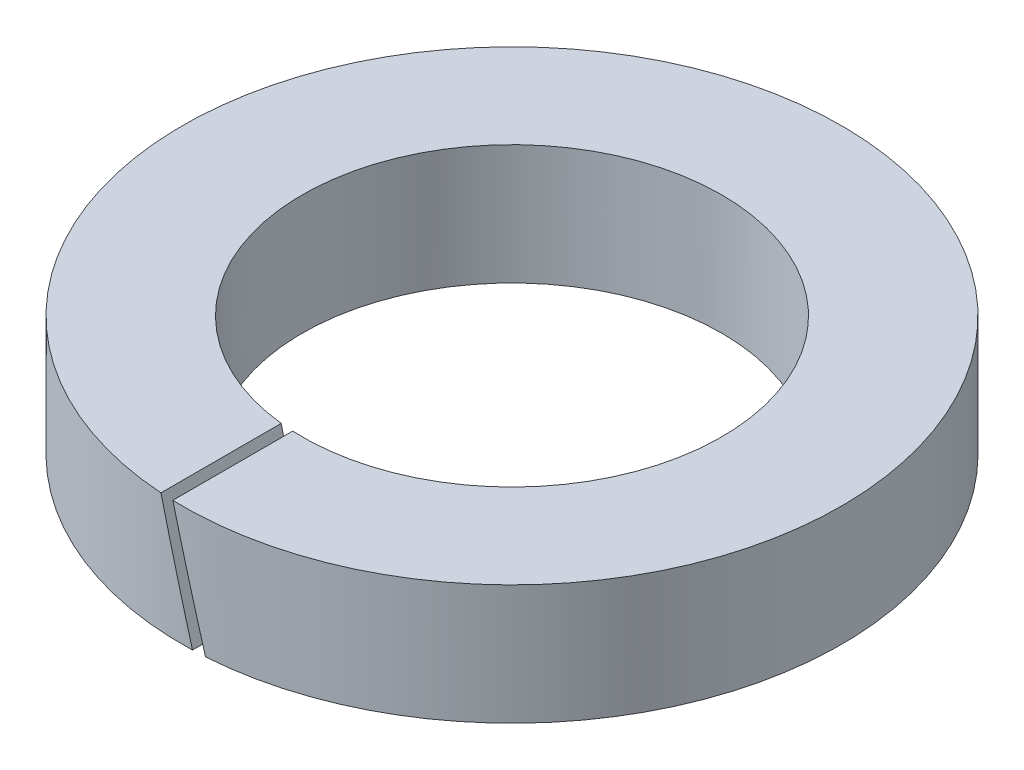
ISO-10303-21;
HEADER;
FILE_DESCRIPTION(('STEP AP214'),'2;1');
FILE_NAME('part.step','',(''),(''),'','','');
FILE_SCHEMA(('AUTOMOTIVE_DESIGN { 1 0 10303 214 1 1 1 1 }'));
ENDSEC;
DATA;
#1=APPLICATION_CONTEXT('core data for automotive mechanical design processes');
#2=APPLICATION_PROTOCOL_DEFINITION('international standard','automotive_design',2000,#1);
#3=PRODUCT_CONTEXT('',#1,'mechanical');
#4=PRODUCT('Part','Part','',(#3));
#5=PRODUCT_RELATED_PRODUCT_CATEGORY('part','',(#4));
#6=PRODUCT_DEFINITION_FORMATION('','',#4);
#7=PRODUCT_DEFINITION_CONTEXT('part definition',#1,'design');
#8=PRODUCT_DEFINITION('design','',#6,#7);
#9=PRODUCT_DEFINITION_SHAPE('','',#8);
#10=(LENGTH_UNIT() NAMED_UNIT(*) SI_UNIT(.MILLI.,.METRE.));
#11=(NAMED_UNIT(*) PLANE_ANGLE_UNIT() SI_UNIT($,.RADIAN.));
#12=(NAMED_UNIT(*) SI_UNIT($,.STERADIAN.) SOLID_ANGLE_UNIT());
#13=UNCERTAINTY_MEASURE_WITH_UNIT(LENGTH_MEASURE(1.E-05),#10,'distance_accuracy_value','');
#14=(GEOMETRIC_REPRESENTATION_CONTEXT(3) GLOBAL_UNCERTAINTY_ASSIGNED_CONTEXT((#13)) GLOBAL_UNIT_ASSIGNED_CONTEXT((#10,
#11,#12)) REPRESENTATION_CONTEXT('',''));
#15=CARTESIAN_POINT('',(0.,0.,0.));
#16=DIRECTION('',(0.,0.,1.));
#17=DIRECTION('',(1.,0.,0.));
#18=AXIS2_PLACEMENT_3D('',#15,#16,#17);
#19=CARTESIAN_POINT('',(0.,0.5,0.));
#20=DIRECTION('',(0.,1.,0.));
#21=DIRECTION('',(0.,0.,1.));
#22=AXIS2_PLACEMENT_3D('',#19,#20,#21);
#23=CYLINDRICAL_SURFACE('',#22,5.25);
#24=CARTESIAN_POINT('',(0.,2.07955549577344,0.));
#25=DIRECTION('',(-0.965925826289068,-0.258819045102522,0.));
#26=DIRECTION('',(-0.258819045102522,0.965925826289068,0.));
#27=AXIS2_PLACEMENT_3D('',#24,#25,#26);
#28=ELLIPSE('',#27,20.2844423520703,5.25);
#29=CARTESIAN_POINT('',(0.557215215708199,0.,5.2203458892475));
#30=VERTEX_POINT('',#29);
#31=CARTESIAN_POINT('',(-0.246632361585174,3.,5.24420370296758));
#32=VERTEX_POINT('',#31);
#33=EDGE_CURVE('E48',#30,#32,#28,.T.);
#34=ORIENTED_EDGE('',*,*,#33,.T.);
#35=CARTESIAN_POINT('',(0.,3.,0.));
#36=DIRECTION('',(0.,1.,0.));
#37=DIRECTION('',(0.,0.,1.));
#38=AXIS2_PLACEMENT_3D('',#35,#36,#37);
#39=CIRCLE('',#38,5.25);
#40=CARTESIAN_POINT('',(-0.557215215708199,3.,5.2203458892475));
#41=VERTEX_POINT('',#40);
#42=EDGE_CURVE('E11',#32,#41,#39,.T.);
#43=ORIENTED_EDGE('',*,*,#42,.T.);
#44=CARTESIAN_POINT('',(0.,0.920444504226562,0.));
#45=DIRECTION('',(-0.965925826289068,-0.258819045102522,0.));
#46=DIRECTION('',(-0.258819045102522,0.965925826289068,0.));
#47=AXIS2_PLACEMENT_3D('',#44,#45,#46);
#48=ELLIPSE('',#47,20.2844423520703,5.25);
#49=CARTESIAN_POINT('',(0.246632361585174,0.,5.24420370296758));
#50=VERTEX_POINT('',#49);
#51=EDGE_CURVE('E97',#50,#41,#48,.T.);
#52=ORIENTED_EDGE('',*,*,#51,.F.);
#53=CARTESIAN_POINT('',(0.,0.,0.));
#54=DIRECTION('',(0.,1.,0.));
#55=DIRECTION('',(0.,0.,1.));
#56=AXIS2_PLACEMENT_3D('',#53,#54,#55);
#57=CIRCLE('',#56,5.25);
#58=EDGE_CURVE('E90',#30,#50,#57,.T.);
#59=ORIENTED_EDGE('',*,*,#58,.F.);
#60=EDGE_LOOP('',(#34,#43,#52,#59));
#61=FACE_BOUND('',#60,.T.);
#62=ADVANCED_FACE('F34',(#61),#23,.F.);
#63=CARTESIAN_POINT('',(5.25,3.,0.));
#64=DIRECTION('',(0.,-1.,0.));
#65=DIRECTION('',(0.,0.,-1.));
#66=AXIS2_PLACEMENT_3D('',#63,#64,#65);
#67=PLANE('',#66);
#68=DIRECTION('',(0.,0.,1.));
#69=VECTOR('',#68,1.);
#70=CARTESIAN_POINT('',(-0.246632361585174,3.,-8.251));
#71=LINE('',#70,#69);
#72=CARTESIAN_POINT('',(-0.246632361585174,3.,8.24631265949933));
#73=VERTEX_POINT('',#72);
#74=EDGE_CURVE('E75',#32,#73,#71,.T.);
#75=ORIENTED_EDGE('',*,*,#74,.T.);
#76=CARTESIAN_POINT('',(0.,3.,0.));
#77=DIRECTION('',(0.,1.,0.));
#78=DIRECTION('',(0.,0.,1.));
#79=AXIS2_PLACEMENT_3D('',#76,#77,#78);
#80=CIRCLE('',#79,8.25);
#81=CARTESIAN_POINT('',(-0.557215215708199,3.,8.2311609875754));
#82=VERTEX_POINT('',#81);
#83=EDGE_CURVE('E41',#73,#82,#80,.T.);
#84=ORIENTED_EDGE('',*,*,#83,.T.);
#85=DIRECTION('',(0.,0.,1.));
#86=VECTOR('',#85,1.);
#87=CARTESIAN_POINT('',(-0.557215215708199,3.,-8.251));
#88=LINE('',#87,#86);
#89=EDGE_CURVE('E99',#41,#82,#88,.T.);
#90=ORIENTED_EDGE('',*,*,#89,.F.);
#91=ORIENTED_EDGE('',*,*,#42,.F.);
#92=EDGE_LOOP('',(#75,#84,#90,#91));
#93=FACE_BOUND('',#92,.T.);
#94=ADVANCED_FACE('F85',(#93),#67,.F.);
#95=CARTESIAN_POINT('',(0.,0.5,0.));
#96=DIRECTION('',(0.,1.,0.));
#97=DIRECTION('',(0.,0.,1.));
#98=AXIS2_PLACEMENT_3D('',#95,#96,#97);
#99=CYLINDRICAL_SURFACE('',#98,8.25);
#100=CARTESIAN_POINT('',(0.,2.07955549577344,0.));
#101=DIRECTION('',(-0.965925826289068,-0.258819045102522,0.));
#102=DIRECTION('',(-0.258819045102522,0.965925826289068,0.));
#103=AXIS2_PLACEMENT_3D('',#100,#101,#102);
#104=ELLIPSE('',#103,31.8755522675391,8.25);
#105=CARTESIAN_POINT('',(0.557215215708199,0.,8.2311609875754));
#106=VERTEX_POINT('',#105);
#107=EDGE_CURVE('E72',#73,#106,#104,.F.);
#108=ORIENTED_EDGE('',*,*,#107,.T.);
#109=CARTESIAN_POINT('',(0.,0.,0.));
#110=DIRECTION('',(0.,1.,0.));
#111=DIRECTION('',(0.,0.,1.));
#112=AXIS2_PLACEMENT_3D('',#109,#110,#111);
#113=CIRCLE('',#112,8.25);
#114=CARTESIAN_POINT('',(0.246632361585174,0.,8.24631265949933));
#115=VERTEX_POINT('',#114);
#116=EDGE_CURVE('E89',#106,#115,#113,.T.);
#117=ORIENTED_EDGE('',*,*,#116,.T.);
#118=CARTESIAN_POINT('',(0.,0.920444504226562,0.));
#119=DIRECTION('',(-0.965925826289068,-0.258819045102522,0.));
#120=DIRECTION('',(-0.258819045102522,0.965925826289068,0.));
#121=AXIS2_PLACEMENT_3D('',#118,#119,#120);
#122=ELLIPSE('',#121,31.8755522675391,8.25);
#123=EDGE_CURVE('E56',#82,#115,#122,.F.);
#124=ORIENTED_EDGE('',*,*,#123,.F.);
#125=ORIENTED_EDGE('',*,*,#83,.F.);
#126=EDGE_LOOP('',(#108,#117,#124,#125));
#127=FACE_BOUND('',#126,.T.);
#128=ADVANCED_FACE('F88',(#127),#99,.T.);
#129=CARTESIAN_POINT('',(5.25,0.,0.));
#130=DIRECTION('',(0.,1.,0.));
#131=DIRECTION('',(0.,0.,1.));
#132=AXIS2_PLACEMENT_3D('',#129,#130,#131);
#133=PLANE('',#132);
#134=DIRECTION('',(0.,0.,-1.));
#135=VECTOR('',#134,1.);
#136=CARTESIAN_POINT('',(0.557215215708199,0.,-8.251));
#137=LINE('',#136,#135);
#138=EDGE_CURVE('E76',#106,#30,#137,.T.);
#139=ORIENTED_EDGE('',*,*,#138,.T.);
#140=ORIENTED_EDGE('',*,*,#58,.T.);
#141=DIRECTION('',(0.,0.,-1.));
#142=VECTOR('',#141,1.);
#143=CARTESIAN_POINT('',(0.246632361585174,0.,-8.251));
#144=LINE('',#143,#142);
#145=EDGE_CURVE('E101',#115,#50,#144,.T.);
#146=ORIENTED_EDGE('',*,*,#145,.F.);
#147=ORIENTED_EDGE('',*,*,#116,.F.);
#148=EDGE_LOOP('',(#139,#140,#146,#147));
#149=FACE_BOUND('',#148,.T.);
#150=ADVANCED_FACE('F108',(#149),#133,.F.);
#151=CARTESIAN_POINT('',(-0.14488887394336,1.46117714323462,-8.251));
#152=DIRECTION('',(-0.965925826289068,-0.258819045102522,0.));
#153=DIRECTION('',(0.258819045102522,-0.965925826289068,0.));
#154=AXIS2_PLACEMENT_3D('',#151,#152,#153);
#155=PLANE('',#154);
#156=ORIENTED_EDGE('',*,*,#51,.T.);
#157=ORIENTED_EDGE('',*,*,#89,.T.);
#158=ORIENTED_EDGE('',*,*,#123,.T.);
#159=ORIENTED_EDGE('',*,*,#145,.T.);
#160=EDGE_LOOP('',(#156,#157,#158,#159));
#161=FACE_BOUND('',#160,.T.);
#162=ADVANCED_FACE('F104',(#161),#155,.F.);
#163=CARTESIAN_POINT('',(0.14488887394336,1.53882285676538,-8.251));
#164=DIRECTION('',(-0.965925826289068,-0.258819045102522,0.));
#165=DIRECTION('',(0.258819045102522,-0.965925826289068,0.));
#166=AXIS2_PLACEMENT_3D('',#163,#164,#165);
#167=PLANE('',#166);
#168=ORIENTED_EDGE('',*,*,#138,.F.);
#169=ORIENTED_EDGE('',*,*,#107,.F.);
#170=ORIENTED_EDGE('',*,*,#74,.F.);
#171=ORIENTED_EDGE('',*,*,#33,.F.);
#172=EDGE_LOOP('',(#168,#169,#170,#171));
#173=FACE_BOUND('',#172,.T.);
#174=ADVANCED_FACE('F74',(#173),#167,.T.);
#175=CLOSED_SHELL('',(#62,#94,#128,#150,#162,#174));
#176=MANIFOLD_SOLID_BREP('B2',#175);
#177=ADVANCED_BREP_SHAPE_REPRESENTATION('',(#18,#176),#14);
#178=SHAPE_DEFINITION_REPRESENTATION(#9,#177);
ENDSEC;
END-ISO-10303-21;
